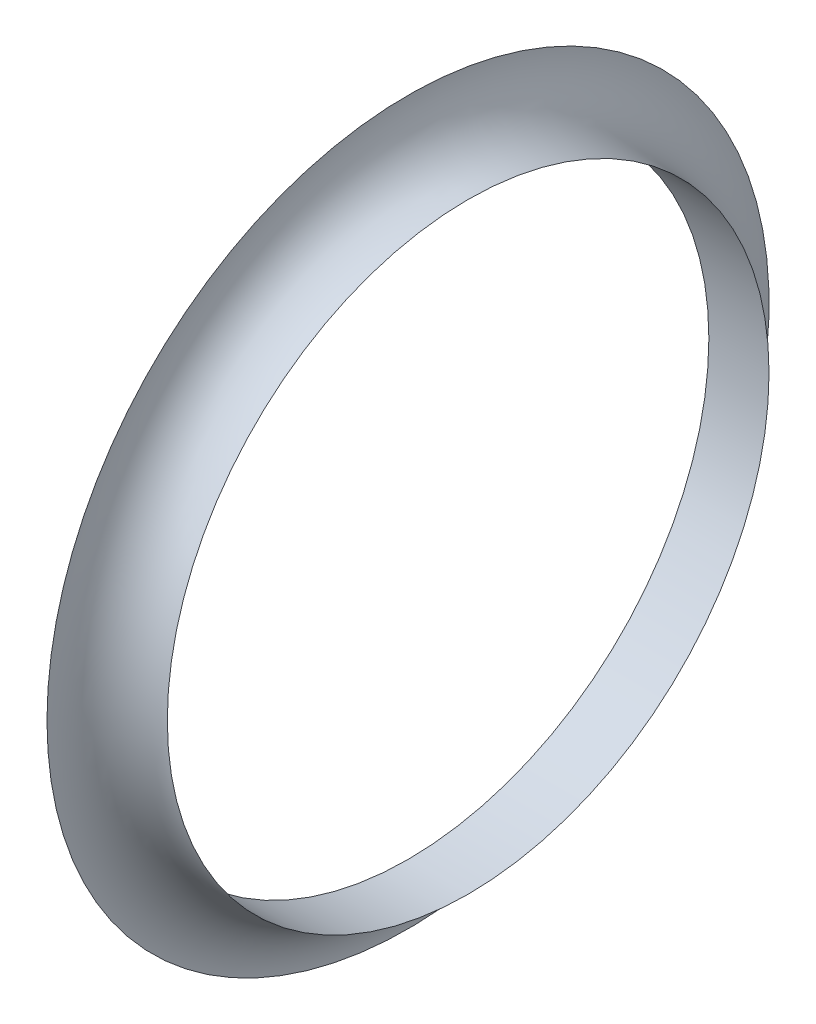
from build123d import *


with BuildPart() as part:
    # Esquisse1 → R_volution1 (revolve)
    with BuildSketch(Plane.XY, mode=Mode.PRIVATE) as r_volution1_sk:
        with BuildLine():
            Line((-5, 30), (-5, 25))
            Line((-5, 25), (0, 25))
            ThreePointArc((0, 25), (-3.535533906, 26.464466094), (-5, 30))
        make_face()
    revolve(r_volution1_sk.sketch.rotate(Axis((0, 0, 0), (1, 0, 0)), 90), axis=Axis((0, 0, 0), (1, 0, 0)))


solid = part.part
